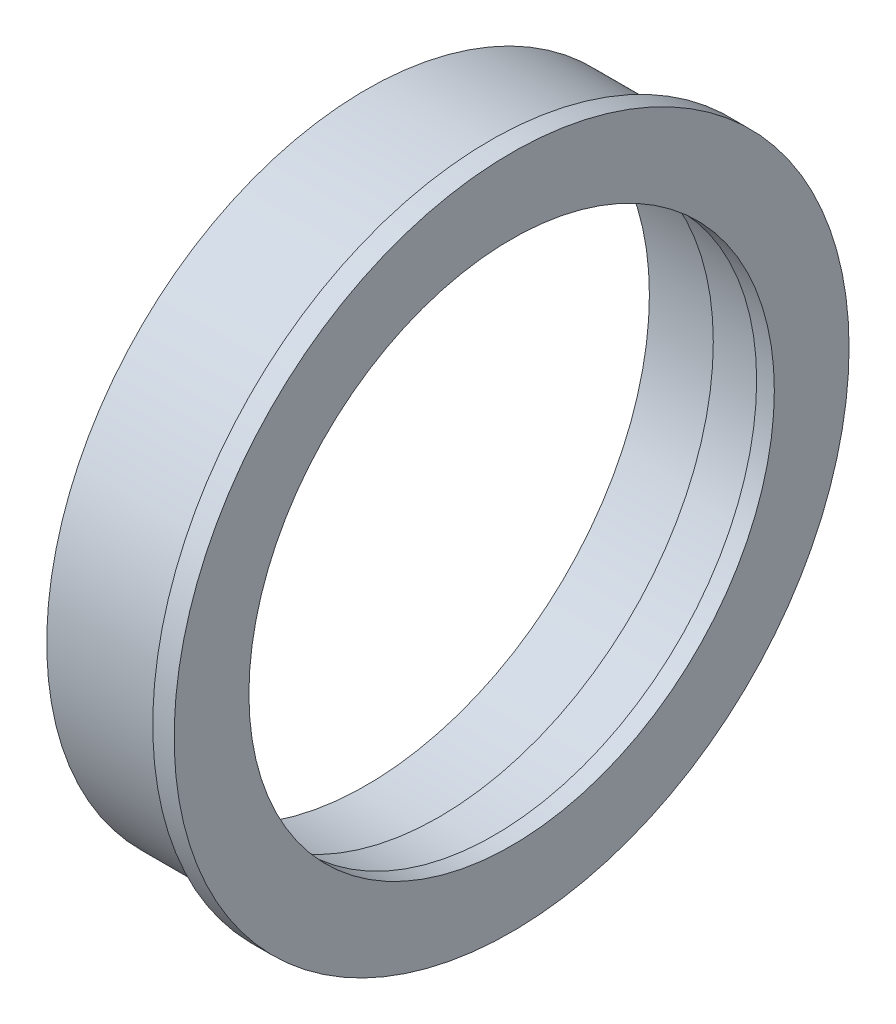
ISO-10303-21;
HEADER;
FILE_DESCRIPTION(('STEP AP214'),'2;1');
FILE_NAME('part.step','',(''),(''),'','','');
FILE_SCHEMA(('AUTOMOTIVE_DESIGN { 1 0 10303 214 1 1 1 1 }'));
ENDSEC;
DATA;
#1=APPLICATION_CONTEXT('core data for automotive mechanical design processes');
#2=APPLICATION_PROTOCOL_DEFINITION('international standard','automotive_design',2000,#1);
#3=PRODUCT_CONTEXT('',#1,'mechanical');
#4=PRODUCT('Part','Part','',(#3));
#5=PRODUCT_RELATED_PRODUCT_CATEGORY('part','',(#4));
#6=PRODUCT_DEFINITION_FORMATION('','',#4);
#7=PRODUCT_DEFINITION_CONTEXT('part definition',#1,'design');
#8=PRODUCT_DEFINITION('design','',#6,#7);
#9=PRODUCT_DEFINITION_SHAPE('','',#8);
#10=(LENGTH_UNIT() NAMED_UNIT(*) SI_UNIT(.MILLI.,.METRE.));
#11=(NAMED_UNIT(*) PLANE_ANGLE_UNIT() SI_UNIT($,.RADIAN.));
#12=(NAMED_UNIT(*) SI_UNIT($,.STERADIAN.) SOLID_ANGLE_UNIT());
#13=UNCERTAINTY_MEASURE_WITH_UNIT(LENGTH_MEASURE(1.E-05),#10,'distance_accuracy_value','');
#14=(GEOMETRIC_REPRESENTATION_CONTEXT(3) GLOBAL_UNCERTAINTY_ASSIGNED_CONTEXT((#13)) GLOBAL_UNIT_ASSIGNED_CONTEXT((#10,
#11,#12)) REPRESENTATION_CONTEXT('',''));
#15=CARTESIAN_POINT('',(0.,0.,0.));
#16=DIRECTION('',(0.,0.,1.));
#17=DIRECTION('',(1.,0.,0.));
#18=AXIS2_PLACEMENT_3D('',#15,#16,#17);
#19=CARTESIAN_POINT('',(0.0439211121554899,19.9344084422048,0.));
#20=DIRECTION('',(1.,0.,0.));
#21=DIRECTION('',(0.,0.,-1.));
#22=AXIS2_PLACEMENT_3D('',#19,#20,#21);
#23=PLANE('',#22);
#24=CARTESIAN_POINT('',(0.0439211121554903,0.,0.));
#25=DIRECTION('',(1.,0.,0.));
#26=DIRECTION('',(0.,0.,-1.));
#27=AXIS2_PLACEMENT_3D('',#24,#25,#26);
#28=CIRCLE('',#27,31.85);
#29=CARTESIAN_POINT('',(0.0439211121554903,0.,-31.85));
#30=VERTEX_POINT('',#29);
#31=EDGE_CURVE('E62',#30,#30,#28,.T.);
#32=ORIENTED_EDGE('',*,*,#31,.F.);
#33=EDGE_LOOP('',(#32));
#34=FACE_BOUND('',#33,.T.);
#35=CARTESIAN_POINT('',(0.0439211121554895,0.,0.));
#36=DIRECTION('',(1.,0.,0.));
#37=DIRECTION('',(0.,0.,-1.));
#38=AXIS2_PLACEMENT_3D('',#35,#36,#37);
#39=CIRCLE('',#38,30.5062013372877);
#40=CARTESIAN_POINT('',(0.0439211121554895,0.,-30.5062013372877));
#41=VERTEX_POINT('',#40);
#42=EDGE_CURVE('E10',#41,#41,#39,.T.);
#43=ORIENTED_EDGE('',*,*,#42,.T.);
#44=EDGE_LOOP('',(#43));
#45=FACE_BOUND('',#44,.T.);
#46=ADVANCED_FACE('F28',(#34,#45),#23,.F.);
#47=CARTESIAN_POINT('',(4.25433201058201,0.,0.));
#48=DIRECTION('',(1.,0.,0.));
#49=DIRECTION('',(0.,0.,-1.));
#50=AXIS2_PLACEMENT_3D('',#47,#48,#49);
#51=CYLINDRICAL_SURFACE('',#50,30.5062013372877);
#52=CARTESIAN_POINT('',(2.09726592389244,0.,0.));
#53=DIRECTION('',(1.,0.,0.));
#54=DIRECTION('',(0.,0.,-1.));
#55=AXIS2_PLACEMENT_3D('',#52,#53,#54);
#56=CIRCLE('',#55,30.5062013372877);
#57=CARTESIAN_POINT('',(2.09726592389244,0.,-30.5062013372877));
#58=VERTEX_POINT('',#57);
#59=EDGE_CURVE('E34',#58,#58,#56,.T.);
#60=ORIENTED_EDGE('',*,*,#59,.T.);
#61=EDGE_LOOP('',(#60));
#62=FACE_BOUND('',#61,.T.);
#63=ORIENTED_EDGE('',*,*,#42,.F.);
#64=EDGE_LOOP('',(#63));
#65=FACE_BOUND('',#64,.T.);
#66=ADVANCED_FACE('F69',(#62,#65),#51,.F.);
#67=CARTESIAN_POINT('',(2.09726592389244,19.9344084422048,0.));
#68=DIRECTION('',(1.,0.,0.));
#69=DIRECTION('',(0.,0.,-1.));
#70=AXIS2_PLACEMENT_3D('',#67,#68,#69);
#71=PLANE('',#70);
#72=CARTESIAN_POINT('',(2.09726592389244,0.,0.));
#73=DIRECTION('',(1.,0.,0.));
#74=DIRECTION('',(0.,0.,-1.));
#75=AXIS2_PLACEMENT_3D('',#72,#73,#74);
#76=CIRCLE('',#75,39.1838699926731);
#77=CARTESIAN_POINT('',(2.09726592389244,0.,-39.1838699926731));
#78=VERTEX_POINT('',#77);
#79=EDGE_CURVE('E38',#78,#78,#76,.T.);
#80=ORIENTED_EDGE('',*,*,#79,.T.);
#81=EDGE_LOOP('',(#80));
#82=FACE_BOUND('',#81,.T.);
#83=ORIENTED_EDGE('',*,*,#59,.F.);
#84=EDGE_LOOP('',(#83));
#85=FACE_BOUND('',#84,.T.);
#86=ADVANCED_FACE('F73',(#82,#85),#71,.T.);
#87=CARTESIAN_POINT('',(4.25433201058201,0.,0.));
#88=DIRECTION('',(1.,0.,0.));
#89=DIRECTION('',(0.,0.,-1.));
#90=AXIS2_PLACEMENT_3D('',#87,#88,#89);
#91=CYLINDRICAL_SURFACE('',#90,39.1838699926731);
#92=CARTESIAN_POINT('',(-0.388834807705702,0.,0.));
#93=DIRECTION('',(1.,0.,0.));
#94=DIRECTION('',(0.,0.,-1.));
#95=AXIS2_PLACEMENT_3D('',#92,#93,#94);
#96=CIRCLE('',#95,39.1838699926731);
#97=CARTESIAN_POINT('',(-0.388834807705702,0.,-39.1838699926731));
#98=VERTEX_POINT('',#97);
#99=EDGE_CURVE('E42',#98,#98,#96,.T.);
#100=ORIENTED_EDGE('',*,*,#99,.T.);
#101=EDGE_LOOP('',(#100));
#102=FACE_BOUND('',#101,.T.);
#103=ORIENTED_EDGE('',*,*,#79,.F.);
#104=EDGE_LOOP('',(#103));
#105=FACE_BOUND('',#104,.T.);
#106=ADVANCED_FACE('F77',(#102,#105),#91,.T.);
#107=CARTESIAN_POINT('',(-0.388834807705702,19.9344084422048,0.));
#108=DIRECTION('',(-1.,0.,0.));
#109=DIRECTION('',(0.,0.,1.));
#110=AXIS2_PLACEMENT_3D('',#107,#108,#109);
#111=PLANE('',#110);
#112=CARTESIAN_POINT('',(-0.388834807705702,0.,0.));
#113=DIRECTION('',(1.,0.,0.));
#114=DIRECTION('',(0.,0.,-1.));
#115=AXIS2_PLACEMENT_3D('',#112,#113,#114);
#116=CIRCLE('',#115,37.0907487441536);
#117=CARTESIAN_POINT('',(-0.388834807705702,0.,-37.0907487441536));
#118=VERTEX_POINT('',#117);
#119=EDGE_CURVE('E47',#118,#118,#116,.T.);
#120=ORIENTED_EDGE('',*,*,#119,.T.);
#121=EDGE_LOOP('',(#120));
#122=FACE_BOUND('',#121,.T.);
#123=ORIENTED_EDGE('',*,*,#99,.F.);
#124=EDGE_LOOP('',(#123));
#125=FACE_BOUND('',#124,.T.);
#126=ADVANCED_FACE('F84',(#122,#125),#111,.T.);
#127=CARTESIAN_POINT('',(4.25433201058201,0.,0.));
#128=DIRECTION('',(1.,0.,0.));
#129=DIRECTION('',(0.,0.,-1.));
#130=AXIS2_PLACEMENT_3D('',#127,#128,#129);
#131=CYLINDRICAL_SURFACE('',#130,37.0907487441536);
#132=CARTESIAN_POINT('',(-14.7918607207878,0.,0.));
#133=DIRECTION('',(1.,0.,0.));
#134=DIRECTION('',(0.,0.,-1.));
#135=AXIS2_PLACEMENT_3D('',#132,#133,#134);
#136=CIRCLE('',#135,37.0907487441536);
#137=CARTESIAN_POINT('',(-14.7918607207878,0.,-37.0907487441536));
#138=VERTEX_POINT('',#137);
#139=EDGE_CURVE('E50',#138,#138,#136,.T.);
#140=ORIENTED_EDGE('',*,*,#139,.T.);
#141=EDGE_LOOP('',(#140));
#142=FACE_BOUND('',#141,.T.);
#143=ORIENTED_EDGE('',*,*,#119,.F.);
#144=EDGE_LOOP('',(#143));
#145=FACE_BOUND('',#144,.T.);
#146=ADVANCED_FACE('F88',(#142,#145),#131,.T.);
#147=CARTESIAN_POINT('',(-14.7918607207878,19.9344084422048,0.));
#148=DIRECTION('',(-1.,0.,0.));
#149=DIRECTION('',(0.,0.,1.));
#150=AXIS2_PLACEMENT_3D('',#147,#148,#149);
#151=PLANE('',#150);
#152=CARTESIAN_POINT('',(-14.7918607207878,0.,0.));
#153=DIRECTION('',(1.,0.,0.));
#154=DIRECTION('',(0.,0.,-1.));
#155=AXIS2_PLACEMENT_3D('',#152,#153,#154);
#156=CIRCLE('',#155,32.8872984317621);
#157=CARTESIAN_POINT('',(-14.7918607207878,0.,-32.8872984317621));
#158=VERTEX_POINT('',#157);
#159=EDGE_CURVE('E53',#158,#158,#156,.T.);
#160=ORIENTED_EDGE('',*,*,#159,.T.);
#161=EDGE_LOOP('',(#160));
#162=FACE_BOUND('',#161,.T.);
#163=ORIENTED_EDGE('',*,*,#139,.F.);
#164=EDGE_LOOP('',(#163));
#165=FACE_BOUND('',#164,.T.);
#166=ADVANCED_FACE('F92',(#162,#165),#151,.T.);
#167=CARTESIAN_POINT('',(4.25433201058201,0.,0.));
#168=DIRECTION('',(1.,0.,0.));
#169=DIRECTION('',(0.,0.,-1.));
#170=AXIS2_PLACEMENT_3D('',#167,#168,#169);
#171=CYLINDRICAL_SURFACE('',#170,32.8872984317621);
#172=CARTESIAN_POINT('',(-6.33394025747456,0.,0.));
#173=DIRECTION('',(1.,0.,0.));
#174=DIRECTION('',(0.,0.,-1.));
#175=AXIS2_PLACEMENT_3D('',#172,#173,#174);
#176=CIRCLE('',#175,32.8872984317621);
#177=CARTESIAN_POINT('',(-6.33394025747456,0.,-32.8872984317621));
#178=VERTEX_POINT('',#177);
#179=EDGE_CURVE('E56',#178,#178,#176,.T.);
#180=ORIENTED_EDGE('',*,*,#179,.T.);
#181=EDGE_LOOP('',(#180));
#182=FACE_BOUND('',#181,.T.);
#183=ORIENTED_EDGE('',*,*,#159,.F.);
#184=EDGE_LOOP('',(#183));
#185=FACE_BOUND('',#184,.T.);
#186=ADVANCED_FACE('F96',(#182,#185),#171,.F.);
#187=CARTESIAN_POINT('',(-6.33394025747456,19.9344084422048,0.));
#188=DIRECTION('',(-1.,0.,0.));
#189=DIRECTION('',(0.,0.,1.));
#190=AXIS2_PLACEMENT_3D('',#187,#188,#189);
#191=PLANE('',#190);
#192=CARTESIAN_POINT('',(-6.33394025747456,0.,0.));
#193=DIRECTION('',(1.,0.,0.));
#194=DIRECTION('',(0.,0.,-1.));
#195=AXIS2_PLACEMENT_3D('',#192,#193,#194);
#196=CIRCLE('',#195,31.85);
#197=CARTESIAN_POINT('',(-6.33394025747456,0.,-31.85));
#198=VERTEX_POINT('',#197);
#199=EDGE_CURVE('E59',#198,#198,#196,.T.);
#200=ORIENTED_EDGE('',*,*,#199,.T.);
#201=EDGE_LOOP('',(#200));
#202=FACE_BOUND('',#201,.T.);
#203=ORIENTED_EDGE('',*,*,#179,.F.);
#204=EDGE_LOOP('',(#203));
#205=FACE_BOUND('',#204,.T.);
#206=ADVANCED_FACE('F100',(#202,#205),#191,.T.);
#207=CARTESIAN_POINT('',(4.25433201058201,0.,0.));
#208=DIRECTION('',(1.,0.,0.));
#209=DIRECTION('',(0.,0.,-1.));
#210=AXIS2_PLACEMENT_3D('',#207,#208,#209);
#211=CYLINDRICAL_SURFACE('',#210,31.85);
#212=ORIENTED_EDGE('',*,*,#199,.F.);
#213=EDGE_LOOP('',(#212));
#214=FACE_BOUND('',#213,.T.);
#215=ORIENTED_EDGE('',*,*,#31,.T.);
#216=EDGE_LOOP('',(#215));
#217=FACE_BOUND('',#216,.T.);
#218=ADVANCED_FACE('F66',(#214,#217),#211,.F.);
#219=CLOSED_SHELL('',(#46,#66,#86,#106,#126,#146,#166,#186,#206,#218));
#220=MANIFOLD_SOLID_BREP('B2',#219);
#221=ADVANCED_BREP_SHAPE_REPRESENTATION('',(#18,#220),#14);
#222=SHAPE_DEFINITION_REPRESENTATION(#9,#221);
ENDSEC;
END-ISO-10303-21;
